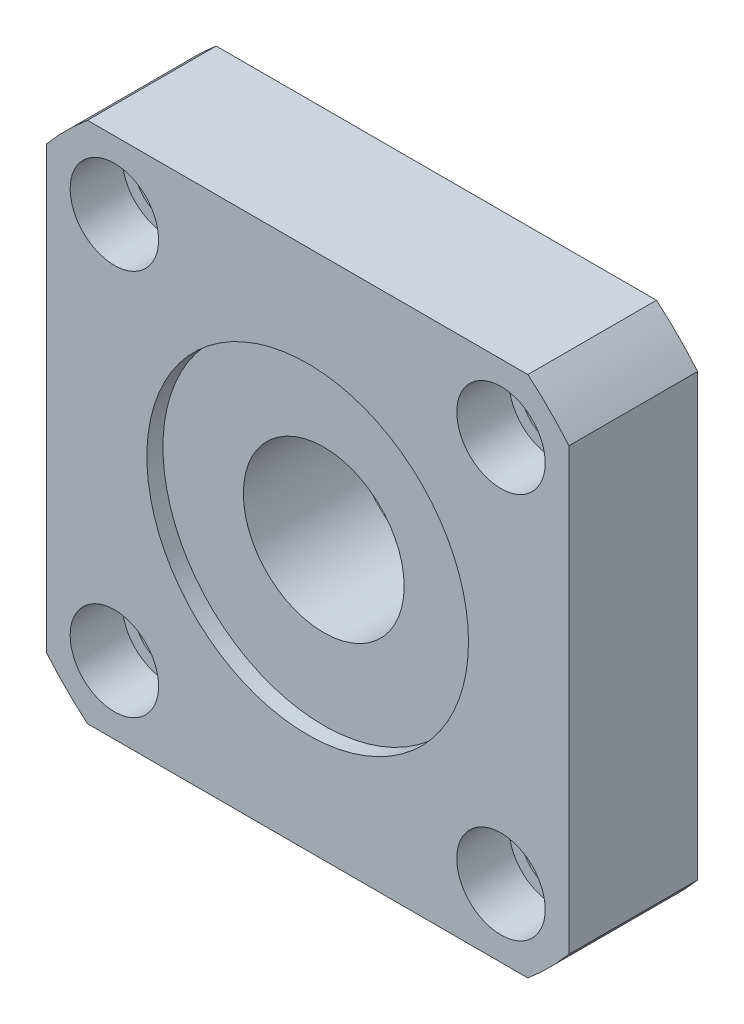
ISO-10303-21;
HEADER;
FILE_DESCRIPTION(('STEP AP214'),'2;1');
FILE_NAME('part.step','',(''),(''),'','','');
FILE_SCHEMA(('AUTOMOTIVE_DESIGN { 1 0 10303 214 1 1 1 1 }'));
ENDSEC;
DATA;
#1=APPLICATION_CONTEXT('core data for automotive mechanical design processes');
#2=APPLICATION_PROTOCOL_DEFINITION('international standard','automotive_design',2000,#1);
#3=PRODUCT_CONTEXT('',#1,'mechanical');
#4=PRODUCT('Part','Part','',(#3));
#5=PRODUCT_RELATED_PRODUCT_CATEGORY('part','',(#4));
#6=PRODUCT_DEFINITION_FORMATION('','',#4);
#7=PRODUCT_DEFINITION_CONTEXT('part definition',#1,'design');
#8=PRODUCT_DEFINITION('design','',#6,#7);
#9=PRODUCT_DEFINITION_SHAPE('','',#8);
#10=(LENGTH_UNIT() NAMED_UNIT(*) SI_UNIT(.MILLI.,.METRE.));
#11=(NAMED_UNIT(*) PLANE_ANGLE_UNIT() SI_UNIT($,.RADIAN.));
#12=(NAMED_UNIT(*) SI_UNIT($,.STERADIAN.) SOLID_ANGLE_UNIT());
#13=UNCERTAINTY_MEASURE_WITH_UNIT(LENGTH_MEASURE(1.E-05),#10,'distance_accuracy_value','');
#14=(GEOMETRIC_REPRESENTATION_CONTEXT(3) GLOBAL_UNCERTAINTY_ASSIGNED_CONTEXT((#13)) GLOBAL_UNIT_ASSIGNED_CONTEXT((#10,
#11,#12)) REPRESENTATION_CONTEXT('',''));
#15=CARTESIAN_POINT('',(0.,0.,0.));
#16=DIRECTION('',(0.,0.,1.));
#17=DIRECTION('',(1.,0.,0.));
#18=AXIS2_PLACEMENT_3D('',#15,#16,#17);
#19=CARTESIAN_POINT('',(0.,0.,16.));
#20=DIRECTION('',(0.,0.,-1.));
#21=DIRECTION('',(-1.,0.,0.));
#22=AXIS2_PLACEMENT_3D('',#19,#20,#21);
#23=CYLINDRICAL_SURFACE('',#22,10.);
#24=CARTESIAN_POINT('',(0.,0.,0.));
#25=DIRECTION('',(0.,0.,1.));
#26=DIRECTION('',(1.,0.,0.));
#27=AXIS2_PLACEMENT_3D('',#24,#25,#26);
#28=CIRCLE('',#27,10.);
#29=CARTESIAN_POINT('',(10.,0.,0.));
#30=VERTEX_POINT('',#29);
#31=EDGE_CURVE('E95',#30,#30,#28,.T.);
#32=ORIENTED_EDGE('',*,*,#31,.F.);
#33=EDGE_LOOP('',(#32));
#34=FACE_BOUND('',#33,.T.);
#35=CARTESIAN_POINT('',(0.,0.,14.));
#36=DIRECTION('',(0.,0.,1.));
#37=DIRECTION('',(1.,0.,0.));
#38=AXIS2_PLACEMENT_3D('',#35,#36,#37);
#39=CIRCLE('',#38,10.);
#40=CARTESIAN_POINT('',(10.,0.,14.));
#41=VERTEX_POINT('',#40);
#42=EDGE_CURVE('E18',#41,#41,#39,.T.);
#43=ORIENTED_EDGE('',*,*,#42,.T.);
#44=EDGE_LOOP('',(#43));
#45=FACE_BOUND('',#44,.T.);
#46=ADVANCED_FACE('F14',(#34,#45),#23,.F.);
#47=CARTESIAN_POINT('',(-24.0416305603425,24.0416305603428,0.));
#48=DIRECTION('',(0.,0.,1.));
#49=DIRECTION('',(1.,0.,0.));
#50=AXIS2_PLACEMENT_3D('',#47,#48,#49);
#51=CYLINDRICAL_SURFACE('',#50,4.);
#52=CARTESIAN_POINT('',(-24.0416305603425,24.0416305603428,0.));
#53=DIRECTION('',(0.,0.,1.));
#54=DIRECTION('',(0.,1.,0.));
#55=AXIS2_PLACEMENT_3D('',#52,#53,#54);
#56=CIRCLE('',#55,4.);
#57=CARTESIAN_POINT('',(-24.0416305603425,28.0416305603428,0.));
#58=VERTEX_POINT('',#57);
#59=EDGE_CURVE('E158',#58,#58,#56,.T.);
#60=ORIENTED_EDGE('',*,*,#59,.F.);
#61=EDGE_LOOP('',(#60));
#62=FACE_BOUND('',#61,.T.);
#63=CARTESIAN_POINT('',(-24.0416305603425,24.0416305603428,9.5));
#64=DIRECTION('',(0.,0.,1.));
#65=DIRECTION('',(1.,0.,0.));
#66=AXIS2_PLACEMENT_3D('',#63,#64,#65);
#67=CIRCLE('',#66,4.);
#68=CARTESIAN_POINT('',(-20.0416305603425,24.0416305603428,9.5));
#69=VERTEX_POINT('',#68);
#70=EDGE_CURVE('E164',#69,#69,#67,.F.);
#71=ORIENTED_EDGE('',*,*,#70,.F.);
#72=EDGE_LOOP('',(#71));
#73=FACE_BOUND('',#72,.T.);
#74=ADVANCED_FACE('F206',(#62,#73),#51,.F.);
#75=CARTESIAN_POINT('',(-24.0416305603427,-24.0416305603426,0.));
#76=DIRECTION('',(0.,0.,1.));
#77=DIRECTION('',(1.,0.,0.));
#78=AXIS2_PLACEMENT_3D('',#75,#76,#77);
#79=CYLINDRICAL_SURFACE('',#78,4.);
#80=CARTESIAN_POINT('',(-24.0416305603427,-24.0416305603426,0.));
#81=DIRECTION('',(0.,0.,1.));
#82=DIRECTION('',(-1.,0.,0.));
#83=AXIS2_PLACEMENT_3D('',#80,#81,#82);
#84=CIRCLE('',#83,4.);
#85=CARTESIAN_POINT('',(-28.0416305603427,-24.0416305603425,0.));
#86=VERTEX_POINT('',#85);
#87=EDGE_CURVE('E189',#86,#86,#84,.T.);
#88=ORIENTED_EDGE('',*,*,#87,.F.);
#89=EDGE_LOOP('',(#88));
#90=FACE_BOUND('',#89,.T.);
#91=CARTESIAN_POINT('',(-24.0416305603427,-24.0416305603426,9.5));
#92=DIRECTION('',(0.,0.,1.));
#93=DIRECTION('',(1.,0.,0.));
#94=AXIS2_PLACEMENT_3D('',#91,#92,#93);
#95=CIRCLE('',#94,4.);
#96=CARTESIAN_POINT('',(-20.0416305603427,-24.0416305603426,9.5));
#97=VERTEX_POINT('',#96);
#98=EDGE_CURVE('E160',#97,#97,#95,.F.);
#99=ORIENTED_EDGE('',*,*,#98,.F.);
#100=EDGE_LOOP('',(#99));
#101=FACE_BOUND('',#100,.T.);
#102=ADVANCED_FACE('F288',(#90,#101),#79,.F.);
#103=CARTESIAN_POINT('',(24.0416305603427,-24.0416305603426,0.));
#104=DIRECTION('',(0.,0.,1.));
#105=DIRECTION('',(1.,0.,0.));
#106=AXIS2_PLACEMENT_3D('',#103,#104,#105);
#107=CYLINDRICAL_SURFACE('',#106,4.);
#108=CARTESIAN_POINT('',(24.0416305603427,-24.0416305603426,0.));
#109=DIRECTION('',(0.,0.,1.));
#110=DIRECTION('',(0.,-1.,0.));
#111=AXIS2_PLACEMENT_3D('',#108,#109,#110);
#112=CIRCLE('',#111,4.);
#113=CARTESIAN_POINT('',(24.0416305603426,-28.0416305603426,0.));
#114=VERTEX_POINT('',#113);
#115=EDGE_CURVE('E192',#114,#114,#112,.T.);
#116=ORIENTED_EDGE('',*,*,#115,.F.);
#117=EDGE_LOOP('',(#116));
#118=FACE_BOUND('',#117,.T.);
#119=CARTESIAN_POINT('',(24.0416305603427,-24.0416305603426,9.5));
#120=DIRECTION('',(0.,0.,1.));
#121=DIRECTION('',(1.,0.,0.));
#122=AXIS2_PLACEMENT_3D('',#119,#120,#121);
#123=CIRCLE('',#122,4.);
#124=CARTESIAN_POINT('',(28.0416305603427,-24.0416305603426,9.5));
#125=VERTEX_POINT('',#124);
#126=EDGE_CURVE('E155',#125,#125,#123,.F.);
#127=ORIENTED_EDGE('',*,*,#126,.F.);
#128=EDGE_LOOP('',(#127));
#129=FACE_BOUND('',#128,.T.);
#130=ADVANCED_FACE('F276',(#118,#129),#107,.F.);
#131=CARTESIAN_POINT('',(24.0416305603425,24.0416305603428,0.));
#132=DIRECTION('',(0.,0.,1.));
#133=DIRECTION('',(1.,0.,0.));
#134=AXIS2_PLACEMENT_3D('',#131,#132,#133);
#135=CYLINDRICAL_SURFACE('',#134,4.);
#136=CARTESIAN_POINT('',(24.0416305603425,24.0416305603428,0.));
#137=DIRECTION('',(0.,0.,1.));
#138=DIRECTION('',(1.,0.,0.));
#139=AXIS2_PLACEMENT_3D('',#136,#137,#138);
#140=CIRCLE('',#139,4.);
#141=CARTESIAN_POINT('',(28.0416305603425,24.0416305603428,0.));
#142=VERTEX_POINT('',#141);
#143=EDGE_CURVE('E153',#142,#142,#140,.T.);
#144=ORIENTED_EDGE('',*,*,#143,.F.);
#145=EDGE_LOOP('',(#144));
#146=FACE_BOUND('',#145,.T.);
#147=CARTESIAN_POINT('',(24.0416305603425,24.0416305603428,9.5));
#148=DIRECTION('',(0.,0.,1.));
#149=DIRECTION('',(1.,0.,0.));
#150=AXIS2_PLACEMENT_3D('',#147,#148,#149);
#151=CIRCLE('',#150,4.);
#152=CARTESIAN_POINT('',(28.0416305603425,24.0416305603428,9.5));
#153=VERTEX_POINT('',#152);
#154=EDGE_CURVE('E150',#153,#153,#151,.F.);
#155=ORIENTED_EDGE('',*,*,#154,.F.);
#156=EDGE_LOOP('',(#155));
#157=FACE_BOUND('',#156,.T.);
#158=ADVANCED_FACE('F225',(#146,#157),#135,.F.);
#159=CARTESIAN_POINT('',(0.,0.,16.));
#160=DIRECTION('',(0.,0.,1.));
#161=DIRECTION('',(1.,0.,0.));
#162=AXIS2_PLACEMENT_3D('',#159,#160,#161);
#163=PLANE('',#162);
#164=CARTESIAN_POINT('',(0.,0.,16.));
#165=DIRECTION('',(0.,0.,1.));
#166=DIRECTION('',(1.,0.,0.));
#167=AXIS2_PLACEMENT_3D('',#164,#165,#166);
#168=CIRCLE('',#167,20.);
#169=CARTESIAN_POINT('',(20.,0.,16.));
#170=VERTEX_POINT('',#169);
#171=EDGE_CURVE('E213',#170,#170,#168,.T.);
#172=ORIENTED_EDGE('',*,*,#171,.F.);
#173=EDGE_LOOP('',(#172));
#174=FACE_BOUND('',#173,.T.);
#175=CARTESIAN_POINT('',(-24.0416305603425,24.0416305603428,16.));
#176=DIRECTION('',(0.,0.,1.));
#177=DIRECTION('',(0.,1.,0.));
#178=AXIS2_PLACEMENT_3D('',#175,#176,#177);
#179=CIRCLE('',#178,5.5);
#180=CARTESIAN_POINT('',(-24.0416305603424,29.5416305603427,16.));
#181=VERTEX_POINT('',#180);
#182=EDGE_CURVE('E173',#181,#181,#179,.T.);
#183=ORIENTED_EDGE('',*,*,#182,.F.);
#184=EDGE_LOOP('',(#183));
#185=FACE_BOUND('',#184,.T.);
#186=CARTESIAN_POINT('',(-24.0416305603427,-24.0416305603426,16.));
#187=DIRECTION('',(0.,0.,1.));
#188=DIRECTION('',(-1.,0.,0.));
#189=AXIS2_PLACEMENT_3D('',#186,#187,#188);
#190=CIRCLE('',#189,5.5);
#191=CARTESIAN_POINT('',(-29.5416305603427,-24.0416305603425,16.));
#192=VERTEX_POINT('',#191);
#193=EDGE_CURVE('E166',#192,#192,#190,.T.);
#194=ORIENTED_EDGE('',*,*,#193,.F.);
#195=EDGE_LOOP('',(#194));
#196=FACE_BOUND('',#195,.T.);
#197=CARTESIAN_POINT('',(24.0416305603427,-24.0416305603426,16.));
#198=DIRECTION('',(0.,0.,1.));
#199=DIRECTION('',(0.,-1.,0.));
#200=AXIS2_PLACEMENT_3D('',#197,#198,#199);
#201=CIRCLE('',#200,5.5);
#202=CARTESIAN_POINT('',(24.0416305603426,-29.5416305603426,16.));
#203=VERTEX_POINT('',#202);
#204=EDGE_CURVE('E162',#203,#203,#201,.T.);
#205=ORIENTED_EDGE('',*,*,#204,.F.);
#206=EDGE_LOOP('',(#205));
#207=FACE_BOUND('',#206,.T.);
#208=CARTESIAN_POINT('',(24.0416305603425,24.0416305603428,16.));
#209=DIRECTION('',(0.,0.,1.));
#210=DIRECTION('',(1.,0.,0.));
#211=AXIS2_PLACEMENT_3D('',#208,#209,#210);
#212=CIRCLE('',#211,5.5);
#213=CARTESIAN_POINT('',(29.5416305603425,24.0416305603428,16.));
#214=VERTEX_POINT('',#213);
#215=EDGE_CURVE('E195',#214,#214,#212,.T.);
#216=ORIENTED_EDGE('',*,*,#215,.F.);
#217=EDGE_LOOP('',(#216));
#218=FACE_BOUND('',#217,.T.);
#219=CARTESIAN_POINT('',(0.,0.,16.));
#220=DIRECTION('',(0.,0.,1.));
#221=DIRECTION('',(1.,0.,0.));
#222=AXIS2_PLACEMENT_3D('',#219,#220,#221);
#223=CIRCLE('',#222,42.5);
#224=CARTESIAN_POINT('',(32.5,27.3861278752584,16.));
#225=VERTEX_POINT('',#224);
#226=CARTESIAN_POINT('',(27.3861278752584,32.5,16.));
#227=VERTEX_POINT('',#226);
#228=EDGE_CURVE('E120',#225,#227,#223,.T.);
#229=ORIENTED_EDGE('',*,*,#228,.T.);
#230=DIRECTION('',(-1.,0.,0.));
#231=VECTOR('',#230,1.);
#232=CARTESIAN_POINT('',(27.3861278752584,32.5,16.));
#233=LINE('',#232,#231);
#234=CARTESIAN_POINT('',(-27.3861278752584,32.5,16.));
#235=VERTEX_POINT('',#234);
#236=EDGE_CURVE('E87',#227,#235,#233,.T.);
#237=ORIENTED_EDGE('',*,*,#236,.T.);
#238=CARTESIAN_POINT('',(0.,0.,16.));
#239=DIRECTION('',(0.,0.,-1.));
#240=DIRECTION('',(-1.,0.,0.));
#241=AXIS2_PLACEMENT_3D('',#238,#239,#240);
#242=CIRCLE('',#241,42.5);
#243=CARTESIAN_POINT('',(-32.5,27.3861278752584,16.));
#244=VERTEX_POINT('',#243);
#245=EDGE_CURVE('E123',#244,#235,#242,.T.);
#246=ORIENTED_EDGE('',*,*,#245,.F.);
#247=DIRECTION('',(0.,-1.,0.));
#248=VECTOR('',#247,1.);
#249=CARTESIAN_POINT('',(-32.5,27.3861278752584,16.));
#250=LINE('',#249,#248);
#251=CARTESIAN_POINT('',(-32.5,-27.3861278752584,16.));
#252=VERTEX_POINT('',#251);
#253=EDGE_CURVE('E126',#244,#252,#250,.T.);
#254=ORIENTED_EDGE('',*,*,#253,.T.);
#255=CARTESIAN_POINT('',(0.,0.,16.));
#256=DIRECTION('',(0.,0.,1.));
#257=DIRECTION('',(1.,0.,0.));
#258=AXIS2_PLACEMENT_3D('',#255,#256,#257);
#259=CIRCLE('',#258,42.5);
#260=CARTESIAN_POINT('',(-27.3861278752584,-32.5,16.));
#261=VERTEX_POINT('',#260);
#262=EDGE_CURVE('E129',#252,#261,#259,.T.);
#263=ORIENTED_EDGE('',*,*,#262,.T.);
#264=DIRECTION('',(-1.,0.,0.));
#265=VECTOR('',#264,1.);
#266=CARTESIAN_POINT('',(27.3861278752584,-32.5,16.));
#267=LINE('',#266,#265);
#268=CARTESIAN_POINT('',(27.3861278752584,-32.5,16.));
#269=VERTEX_POINT('',#268);
#270=EDGE_CURVE('E132',#269,#261,#267,.T.);
#271=ORIENTED_EDGE('',*,*,#270,.F.);
#272=CARTESIAN_POINT('',(0.,0.,16.));
#273=DIRECTION('',(0.,0.,-1.));
#274=DIRECTION('',(-1.,0.,0.));
#275=AXIS2_PLACEMENT_3D('',#272,#273,#274);
#276=CIRCLE('',#275,42.5);
#277=CARTESIAN_POINT('',(32.5,-27.3861278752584,16.));
#278=VERTEX_POINT('',#277);
#279=EDGE_CURVE('E135',#278,#269,#276,.T.);
#280=ORIENTED_EDGE('',*,*,#279,.F.);
#281=DIRECTION('',(0.,-1.,0.));
#282=VECTOR('',#281,1.);
#283=CARTESIAN_POINT('',(32.5,27.3861278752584,16.));
#284=LINE('',#283,#282);
#285=EDGE_CURVE('E137',#225,#278,#284,.T.);
#286=ORIENTED_EDGE('',*,*,#285,.F.);
#287=EDGE_LOOP('',(#229,#237,#246,#254,#263,#271,#280,#286));
#288=FACE_BOUND('',#287,.T.);
#289=ADVANCED_FACE('F222',(#174,#185,#196,#207,#218,#288),#163,.T.);
#290=CARTESIAN_POINT('',(0.,0.,0.));
#291=DIRECTION('',(0.,0.,1.));
#292=DIRECTION('',(1.,0.,0.));
#293=AXIS2_PLACEMENT_3D('',#290,#291,#292);
#294=PLANE('',#293);
#295=ORIENTED_EDGE('',*,*,#59,.T.);
#296=EDGE_LOOP('',(#295));
#297=FACE_BOUND('',#296,.T.);
#298=ORIENTED_EDGE('',*,*,#87,.T.);
#299=EDGE_LOOP('',(#298));
#300=FACE_BOUND('',#299,.T.);
#301=ORIENTED_EDGE('',*,*,#115,.T.);
#302=EDGE_LOOP('',(#301));
#303=FACE_BOUND('',#302,.T.);
#304=ORIENTED_EDGE('',*,*,#143,.T.);
#305=EDGE_LOOP('',(#304));
#306=FACE_BOUND('',#305,.T.);
#307=CARTESIAN_POINT('',(0.,0.,0.));
#308=DIRECTION('',(0.,0.,1.));
#309=DIRECTION('',(1.,0.,0.));
#310=AXIS2_PLACEMENT_3D('',#307,#308,#309);
#311=CIRCLE('',#310,42.5);
#312=CARTESIAN_POINT('',(32.5,27.3861278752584,0.));
#313=VERTEX_POINT('',#312);
#314=CARTESIAN_POINT('',(27.3861278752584,32.5,0.));
#315=VERTEX_POINT('',#314);
#316=EDGE_CURVE('E91',#313,#315,#311,.T.);
#317=ORIENTED_EDGE('',*,*,#316,.F.);
#318=DIRECTION('',(0.,-1.,0.));
#319=VECTOR('',#318,1.);
#320=CARTESIAN_POINT('',(32.5,27.3861278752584,0.));
#321=LINE('',#320,#319);
#322=CARTESIAN_POINT('',(32.5,-27.3861278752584,0.));
#323=VERTEX_POINT('',#322);
#324=EDGE_CURVE('E118',#313,#323,#321,.T.);
#325=ORIENTED_EDGE('',*,*,#324,.T.);
#326=CARTESIAN_POINT('',(0.,0.,0.));
#327=DIRECTION('',(0.,0.,-1.));
#328=DIRECTION('',(-1.,0.,0.));
#329=AXIS2_PLACEMENT_3D('',#326,#327,#328);
#330=CIRCLE('',#329,42.5);
#331=CARTESIAN_POINT('',(27.3861278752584,-32.5,0.));
#332=VERTEX_POINT('',#331);
#333=EDGE_CURVE('E115',#323,#332,#330,.T.);
#334=ORIENTED_EDGE('',*,*,#333,.T.);
#335=DIRECTION('',(-1.,0.,0.));
#336=VECTOR('',#335,1.);
#337=CARTESIAN_POINT('',(27.3861278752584,-32.5,0.));
#338=LINE('',#337,#336);
#339=CARTESIAN_POINT('',(-27.3861278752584,-32.5,0.));
#340=VERTEX_POINT('',#339);
#341=EDGE_CURVE('E112',#332,#340,#338,.T.);
#342=ORIENTED_EDGE('',*,*,#341,.T.);
#343=CARTESIAN_POINT('',(0.,0.,0.));
#344=DIRECTION('',(0.,0.,1.));
#345=DIRECTION('',(1.,0.,0.));
#346=AXIS2_PLACEMENT_3D('',#343,#344,#345);
#347=CIRCLE('',#346,42.5);
#348=CARTESIAN_POINT('',(-32.5,-27.3861278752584,0.));
#349=VERTEX_POINT('',#348);
#350=EDGE_CURVE('E109',#349,#340,#347,.T.);
#351=ORIENTED_EDGE('',*,*,#350,.F.);
#352=DIRECTION('',(0.,-1.,0.));
#353=VECTOR('',#352,1.);
#354=CARTESIAN_POINT('',(-32.5,27.3861278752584,0.));
#355=LINE('',#354,#353);
#356=CARTESIAN_POINT('',(-32.5,27.3861278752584,0.));
#357=VERTEX_POINT('',#356);
#358=EDGE_CURVE('E103',#357,#349,#355,.T.);
#359=ORIENTED_EDGE('',*,*,#358,.F.);
#360=CARTESIAN_POINT('',(0.,0.,0.));
#361=DIRECTION('',(0.,0.,-1.));
#362=DIRECTION('',(-1.,0.,0.));
#363=AXIS2_PLACEMENT_3D('',#360,#361,#362);
#364=CIRCLE('',#363,42.5);
#365=CARTESIAN_POINT('',(-27.3861278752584,32.5,0.));
#366=VERTEX_POINT('',#365);
#367=EDGE_CURVE('E101',#357,#366,#364,.T.);
#368=ORIENTED_EDGE('',*,*,#367,.T.);
#369=DIRECTION('',(-1.,0.,0.));
#370=VECTOR('',#369,1.);
#371=CARTESIAN_POINT('',(27.3861278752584,32.5,0.));
#372=LINE('',#371,#370);
#373=EDGE_CURVE('E84',#315,#366,#372,.T.);
#374=ORIENTED_EDGE('',*,*,#373,.F.);
#375=EDGE_LOOP('',(#317,#325,#334,#342,#351,#359,#368,#374));
#376=FACE_BOUND('',#375,.T.);
#377=ORIENTED_EDGE('',*,*,#31,.T.);
#378=EDGE_LOOP('',(#377));
#379=FACE_BOUND('',#378,.T.);
#380=ADVANCED_FACE('F97',(#297,#300,#303,#306,#376,#379),#294,.F.);
#381=CARTESIAN_POINT('',(0.,0.,16.));
#382=DIRECTION('',(0.,0.,-1.));
#383=DIRECTION('',(-1.,0.,0.));
#384=AXIS2_PLACEMENT_3D('',#381,#382,#383);
#385=CYLINDRICAL_SURFACE('',#384,42.5);
#386=DIRECTION('',(0.,0.,-1.));
#387=VECTOR('',#386,1.);
#388=CARTESIAN_POINT('',(27.3861278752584,32.5,16.));
#389=LINE('',#388,#387);
#390=EDGE_CURVE('E9',#227,#315,#389,.T.);
#391=ORIENTED_EDGE('',*,*,#390,.F.);
#392=ORIENTED_EDGE('',*,*,#228,.F.);
#393=DIRECTION('',(0.,0.,-1.));
#394=VECTOR('',#393,1.);
#395=CARTESIAN_POINT('',(32.5,27.3861278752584,16.));
#396=LINE('',#395,#394);
#397=EDGE_CURVE('E31',#225,#313,#396,.T.);
#398=ORIENTED_EDGE('',*,*,#397,.T.);
#399=ORIENTED_EDGE('',*,*,#316,.T.);
#400=EDGE_LOOP('',(#391,#392,#398,#399));
#401=FACE_BOUND('',#400,.T.);
#402=ADVANCED_FACE('F92',(#401),#385,.T.);
#403=CARTESIAN_POINT('',(27.3861278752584,32.5,16.));
#404=DIRECTION('',(0.,-1.,0.));
#405=DIRECTION('',(0.,0.,-1.));
#406=AXIS2_PLACEMENT_3D('',#403,#404,#405);
#407=PLANE('',#406);
#408=DIRECTION('',(0.,0.,-1.));
#409=VECTOR('',#408,1.);
#410=CARTESIAN_POINT('',(-27.3861278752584,32.5,16.));
#411=LINE('',#410,#409);
#412=EDGE_CURVE('E23',#235,#366,#411,.T.);
#413=ORIENTED_EDGE('',*,*,#412,.F.);
#414=ORIENTED_EDGE('',*,*,#236,.F.);
#415=ORIENTED_EDGE('',*,*,#390,.T.);
#416=ORIENTED_EDGE('',*,*,#373,.T.);
#417=EDGE_LOOP('',(#413,#414,#415,#416));
#418=FACE_BOUND('',#417,.T.);
#419=ADVANCED_FACE('F16',(#418),#407,.F.);
#420=CARTESIAN_POINT('',(0.,0.,16.));
#421=DIRECTION('',(0.,0.,-1.));
#422=DIRECTION('',(-1.,0.,0.));
#423=AXIS2_PLACEMENT_3D('',#420,#421,#422);
#424=CYLINDRICAL_SURFACE('',#423,42.5);
#425=DIRECTION('',(0.,0.,-1.));
#426=VECTOR('',#425,1.);
#427=CARTESIAN_POINT('',(-32.5,27.3861278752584,16.));
#428=LINE('',#427,#426);
#429=EDGE_CURVE('E147',#244,#357,#428,.T.);
#430=ORIENTED_EDGE('',*,*,#429,.F.);
#431=ORIENTED_EDGE('',*,*,#245,.T.);
#432=ORIENTED_EDGE('',*,*,#412,.T.);
#433=ORIENTED_EDGE('',*,*,#367,.F.);
#434=EDGE_LOOP('',(#430,#431,#432,#433));
#435=FACE_BOUND('',#434,.T.);
#436=ADVANCED_FACE('F251',(#435),#424,.T.);
#437=CARTESIAN_POINT('',(-32.5,27.3861278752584,16.));
#438=DIRECTION('',(1.,0.,0.));
#439=DIRECTION('',(0.,0.,-1.));
#440=AXIS2_PLACEMENT_3D('',#437,#438,#439);
#441=PLANE('',#440);
#442=DIRECTION('',(0.,0.,-1.));
#443=VECTOR('',#442,1.);
#444=CARTESIAN_POINT('',(-32.5,-27.3861278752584,16.));
#445=LINE('',#444,#443);
#446=EDGE_CURVE('E145',#252,#349,#445,.T.);
#447=ORIENTED_EDGE('',*,*,#446,.F.);
#448=ORIENTED_EDGE('',*,*,#253,.F.);
#449=ORIENTED_EDGE('',*,*,#429,.T.);
#450=ORIENTED_EDGE('',*,*,#358,.T.);
#451=EDGE_LOOP('',(#447,#448,#449,#450));
#452=FACE_BOUND('',#451,.T.);
#453=ADVANCED_FACE('F249',(#452),#441,.F.);
#454=CARTESIAN_POINT('',(0.,0.,16.));
#455=DIRECTION('',(0.,0.,-1.));
#456=DIRECTION('',(-1.,0.,0.));
#457=AXIS2_PLACEMENT_3D('',#454,#455,#456);
#458=CYLINDRICAL_SURFACE('',#457,42.5);
#459=DIRECTION('',(0.,0.,-1.));
#460=VECTOR('',#459,1.);
#461=CARTESIAN_POINT('',(-27.3861278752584,-32.5,16.));
#462=LINE('',#461,#460);
#463=EDGE_CURVE('E143',#261,#340,#462,.T.);
#464=ORIENTED_EDGE('',*,*,#463,.F.);
#465=ORIENTED_EDGE('',*,*,#262,.F.);
#466=ORIENTED_EDGE('',*,*,#446,.T.);
#467=ORIENTED_EDGE('',*,*,#350,.T.);
#468=EDGE_LOOP('',(#464,#465,#466,#467));
#469=FACE_BOUND('',#468,.T.);
#470=ADVANCED_FACE('F246',(#469),#458,.T.);
#471=CARTESIAN_POINT('',(27.3861278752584,-32.5,16.));
#472=DIRECTION('',(0.,-1.,0.));
#473=DIRECTION('',(0.,0.,-1.));
#474=AXIS2_PLACEMENT_3D('',#471,#472,#473);
#475=PLANE('',#474);
#476=DIRECTION('',(0.,0.,-1.));
#477=VECTOR('',#476,1.);
#478=CARTESIAN_POINT('',(27.3861278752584,-32.5,16.));
#479=LINE('',#478,#477);
#480=EDGE_CURVE('E141',#269,#332,#479,.T.);
#481=ORIENTED_EDGE('',*,*,#480,.F.);
#482=ORIENTED_EDGE('',*,*,#270,.T.);
#483=ORIENTED_EDGE('',*,*,#463,.T.);
#484=ORIENTED_EDGE('',*,*,#341,.F.);
#485=EDGE_LOOP('',(#481,#482,#483,#484));
#486=FACE_BOUND('',#485,.T.);
#487=ADVANCED_FACE('F243',(#486),#475,.T.);
#488=CARTESIAN_POINT('',(0.,0.,16.));
#489=DIRECTION('',(0.,0.,-1.));
#490=DIRECTION('',(-1.,0.,0.));
#491=AXIS2_PLACEMENT_3D('',#488,#489,#490);
#492=CYLINDRICAL_SURFACE('',#491,42.5);
#493=DIRECTION('',(0.,0.,-1.));
#494=VECTOR('',#493,1.);
#495=CARTESIAN_POINT('',(32.5,-27.3861278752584,16.));
#496=LINE('',#495,#494);
#497=EDGE_CURVE('E39',#278,#323,#496,.T.);
#498=ORIENTED_EDGE('',*,*,#497,.F.);
#499=ORIENTED_EDGE('',*,*,#279,.T.);
#500=ORIENTED_EDGE('',*,*,#480,.T.);
#501=ORIENTED_EDGE('',*,*,#333,.F.);
#502=EDGE_LOOP('',(#498,#499,#500,#501));
#503=FACE_BOUND('',#502,.T.);
#504=ADVANCED_FACE('F239',(#503),#492,.T.);
#505=CARTESIAN_POINT('',(32.5,27.3861278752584,16.));
#506=DIRECTION('',(1.,0.,0.));
#507=DIRECTION('',(0.,0.,-1.));
#508=AXIS2_PLACEMENT_3D('',#505,#506,#507);
#509=PLANE('',#508);
#510=ORIENTED_EDGE('',*,*,#285,.T.);
#511=ORIENTED_EDGE('',*,*,#497,.T.);
#512=ORIENTED_EDGE('',*,*,#324,.F.);
#513=ORIENTED_EDGE('',*,*,#397,.F.);
#514=EDGE_LOOP('',(#510,#511,#512,#513));
#515=FACE_BOUND('',#514,.T.);
#516=ADVANCED_FACE('F238',(#515),#509,.T.);
#517=CARTESIAN_POINT('',(24.0416305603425,24.0416305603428,9.5));
#518=DIRECTION('',(0.,0.,1.));
#519=DIRECTION('',(1.,0.,0.));
#520=AXIS2_PLACEMENT_3D('',#517,#518,#519);
#521=PLANE('',#520);
#522=CARTESIAN_POINT('',(24.0416305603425,24.0416305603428,9.5));
#523=DIRECTION('',(0.,0.,1.));
#524=DIRECTION('',(1.,0.,0.));
#525=AXIS2_PLACEMENT_3D('',#522,#523,#524);
#526=CIRCLE('',#525,5.5);
#527=CARTESIAN_POINT('',(29.5416305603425,24.0416305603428,9.5));
#528=VERTEX_POINT('',#527);
#529=EDGE_CURVE('E154',#528,#528,#526,.T.);
#530=ORIENTED_EDGE('',*,*,#529,.T.);
#531=EDGE_LOOP('',(#530));
#532=FACE_BOUND('',#531,.T.);
#533=ORIENTED_EDGE('',*,*,#154,.T.);
#534=EDGE_LOOP('',(#533));
#535=FACE_BOUND('',#534,.T.);
#536=ADVANCED_FACE('F268',(#532,#535),#521,.T.);
#537=CARTESIAN_POINT('',(24.0416305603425,24.0416305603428,9.5));
#538=DIRECTION('',(0.,0.,1.));
#539=DIRECTION('',(1.,0.,0.));
#540=AXIS2_PLACEMENT_3D('',#537,#538,#539);
#541=CYLINDRICAL_SURFACE('',#540,5.5);
#542=ORIENTED_EDGE('',*,*,#529,.F.);
#543=EDGE_LOOP('',(#542));
#544=FACE_BOUND('',#543,.T.);
#545=ORIENTED_EDGE('',*,*,#215,.T.);
#546=EDGE_LOOP('',(#545));
#547=FACE_BOUND('',#546,.T.);
#548=ADVANCED_FACE('F278',(#544,#547),#541,.F.);
#549=CARTESIAN_POINT('',(24.0416305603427,-24.0416305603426,9.5));
#550=DIRECTION('',(0.,0.,1.));
#551=DIRECTION('',(0.,-1.,0.));
#552=AXIS2_PLACEMENT_3D('',#549,#550,#551);
#553=PLANE('',#552);
#554=CARTESIAN_POINT('',(24.0416305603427,-24.0416305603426,9.5));
#555=DIRECTION('',(0.,0.,1.));
#556=DIRECTION('',(0.,-1.,0.));
#557=AXIS2_PLACEMENT_3D('',#554,#555,#556);
#558=CIRCLE('',#557,5.5);
#559=CARTESIAN_POINT('',(24.0416305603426,-29.5416305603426,9.5));
#560=VERTEX_POINT('',#559);
#561=EDGE_CURVE('E159',#560,#560,#558,.T.);
#562=ORIENTED_EDGE('',*,*,#561,.T.);
#563=EDGE_LOOP('',(#562));
#564=FACE_BOUND('',#563,.T.);
#565=ORIENTED_EDGE('',*,*,#126,.T.);
#566=EDGE_LOOP('',(#565));
#567=FACE_BOUND('',#566,.T.);
#568=ADVANCED_FACE('F281',(#564,#567),#553,.T.);
#569=CARTESIAN_POINT('',(24.0416305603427,-24.0416305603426,9.5));
#570=DIRECTION('',(0.,0.,1.));
#571=DIRECTION('',(1.,0.,0.));
#572=AXIS2_PLACEMENT_3D('',#569,#570,#571);
#573=CYLINDRICAL_SURFACE('',#572,5.5);
#574=ORIENTED_EDGE('',*,*,#561,.F.);
#575=EDGE_LOOP('',(#574));
#576=FACE_BOUND('',#575,.T.);
#577=ORIENTED_EDGE('',*,*,#204,.T.);
#578=EDGE_LOOP('',(#577));
#579=FACE_BOUND('',#578,.T.);
#580=ADVANCED_FACE('F296',(#576,#579),#573,.F.);
#581=CARTESIAN_POINT('',(-24.0416305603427,-24.0416305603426,9.5));
#582=DIRECTION('',(0.,0.,1.));
#583=DIRECTION('',(-1.,0.,0.));
#584=AXIS2_PLACEMENT_3D('',#581,#582,#583);
#585=PLANE('',#584);
#586=CARTESIAN_POINT('',(-24.0416305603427,-24.0416305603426,9.5));
#587=DIRECTION('',(0.,0.,1.));
#588=DIRECTION('',(-1.,0.,0.));
#589=AXIS2_PLACEMENT_3D('',#586,#587,#588);
#590=CIRCLE('',#589,5.5);
#591=CARTESIAN_POINT('',(-29.5416305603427,-24.0416305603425,9.5));
#592=VERTEX_POINT('',#591);
#593=EDGE_CURVE('E163',#592,#592,#590,.T.);
#594=ORIENTED_EDGE('',*,*,#593,.T.);
#595=EDGE_LOOP('',(#594));
#596=FACE_BOUND('',#595,.T.);
#597=ORIENTED_EDGE('',*,*,#98,.T.);
#598=EDGE_LOOP('',(#597));
#599=FACE_BOUND('',#598,.T.);
#600=ADVANCED_FACE('F299',(#596,#599),#585,.T.);
#601=CARTESIAN_POINT('',(-24.0416305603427,-24.0416305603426,9.5));
#602=DIRECTION('',(0.,0.,1.));
#603=DIRECTION('',(1.,0.,0.));
#604=AXIS2_PLACEMENT_3D('',#601,#602,#603);
#605=CYLINDRICAL_SURFACE('',#604,5.5);
#606=ORIENTED_EDGE('',*,*,#593,.F.);
#607=EDGE_LOOP('',(#606));
#608=FACE_BOUND('',#607,.T.);
#609=ORIENTED_EDGE('',*,*,#193,.T.);
#610=EDGE_LOOP('',(#609));
#611=FACE_BOUND('',#610,.T.);
#612=ADVANCED_FACE('F304',(#608,#611),#605,.F.);
#613=CARTESIAN_POINT('',(-24.0416305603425,24.0416305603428,9.5));
#614=DIRECTION('',(0.,0.,1.));
#615=DIRECTION('',(0.,1.,0.));
#616=AXIS2_PLACEMENT_3D('',#613,#614,#615);
#617=PLANE('',#616);
#618=CARTESIAN_POINT('',(-24.0416305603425,24.0416305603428,9.5));
#619=DIRECTION('',(0.,0.,1.));
#620=DIRECTION('',(0.,1.,0.));
#621=AXIS2_PLACEMENT_3D('',#618,#619,#620);
#622=CIRCLE('',#621,5.5);
#623=CARTESIAN_POINT('',(-24.0416305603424,29.5416305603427,9.5));
#624=VERTEX_POINT('',#623);
#625=EDGE_CURVE('E167',#624,#624,#622,.T.);
#626=ORIENTED_EDGE('',*,*,#625,.T.);
#627=EDGE_LOOP('',(#626));
#628=FACE_BOUND('',#627,.T.);
#629=ORIENTED_EDGE('',*,*,#70,.T.);
#630=EDGE_LOOP('',(#629));
#631=FACE_BOUND('',#630,.T.);
#632=ADVANCED_FACE('F307',(#628,#631),#617,.T.);
#633=CARTESIAN_POINT('',(-24.0416305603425,24.0416305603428,9.5));
#634=DIRECTION('',(0.,0.,1.));
#635=DIRECTION('',(1.,0.,0.));
#636=AXIS2_PLACEMENT_3D('',#633,#634,#635);
#637=CYLINDRICAL_SURFACE('',#636,5.5);
#638=ORIENTED_EDGE('',*,*,#625,.F.);
#639=EDGE_LOOP('',(#638));
#640=FACE_BOUND('',#639,.T.);
#641=ORIENTED_EDGE('',*,*,#182,.T.);
#642=EDGE_LOOP('',(#641));
#643=FACE_BOUND('',#642,.T.);
#644=ADVANCED_FACE('F312',(#640,#643),#637,.F.);
#645=CARTESIAN_POINT('',(0.,0.,14.));
#646=DIRECTION('',(0.,0.,1.));
#647=DIRECTION('',(1.,0.,0.));
#648=AXIS2_PLACEMENT_3D('',#645,#646,#647);
#649=CYLINDRICAL_SURFACE('',#648,20.);
#650=CARTESIAN_POINT('',(0.,0.,14.));
#651=DIRECTION('',(0.,0.,1.));
#652=DIRECTION('',(1.,0.,0.));
#653=AXIS2_PLACEMENT_3D('',#650,#651,#652);
#654=CIRCLE('',#653,20.);
#655=CARTESIAN_POINT('',(20.,0.,14.));
#656=VERTEX_POINT('',#655);
#657=EDGE_CURVE('E211',#656,#656,#654,.T.);
#658=ORIENTED_EDGE('',*,*,#657,.F.);
#659=EDGE_LOOP('',(#658));
#660=FACE_BOUND('',#659,.T.);
#661=ORIENTED_EDGE('',*,*,#171,.T.);
#662=EDGE_LOOP('',(#661));
#663=FACE_BOUND('',#662,.T.);
#664=ADVANCED_FACE('F220',(#660,#663),#649,.F.);
#665=CARTESIAN_POINT('',(0.,0.,14.));
#666=DIRECTION('',(0.,0.,1.));
#667=DIRECTION('',(1.,0.,0.));
#668=AXIS2_PLACEMENT_3D('',#665,#666,#667);
#669=PLANE('',#668);
#670=ORIENTED_EDGE('',*,*,#42,.F.);
#671=EDGE_LOOP('',(#670));
#672=FACE_BOUND('',#671,.T.);
#673=ORIENTED_EDGE('',*,*,#657,.T.);
#674=EDGE_LOOP('',(#673));
#675=FACE_BOUND('',#674,.T.);
#676=ADVANCED_FACE('F316',(#672,#675),#669,.T.);
#677=CLOSED_SHELL('',(#46,#74,#102,#130,#158,#289,#380,#402,#419,#436,#453,#470,#487,#504,#516,
#536,#548,#568,#580,#600,#612,#632,#644,#664,#676));
#678=MANIFOLD_SOLID_BREP('B1',#677);
#679=ADVANCED_BREP_SHAPE_REPRESENTATION('',(#18,#678),#14);
#680=SHAPE_DEFINITION_REPRESENTATION(#9,#679);
ENDSEC;
END-ISO-10303-21;
